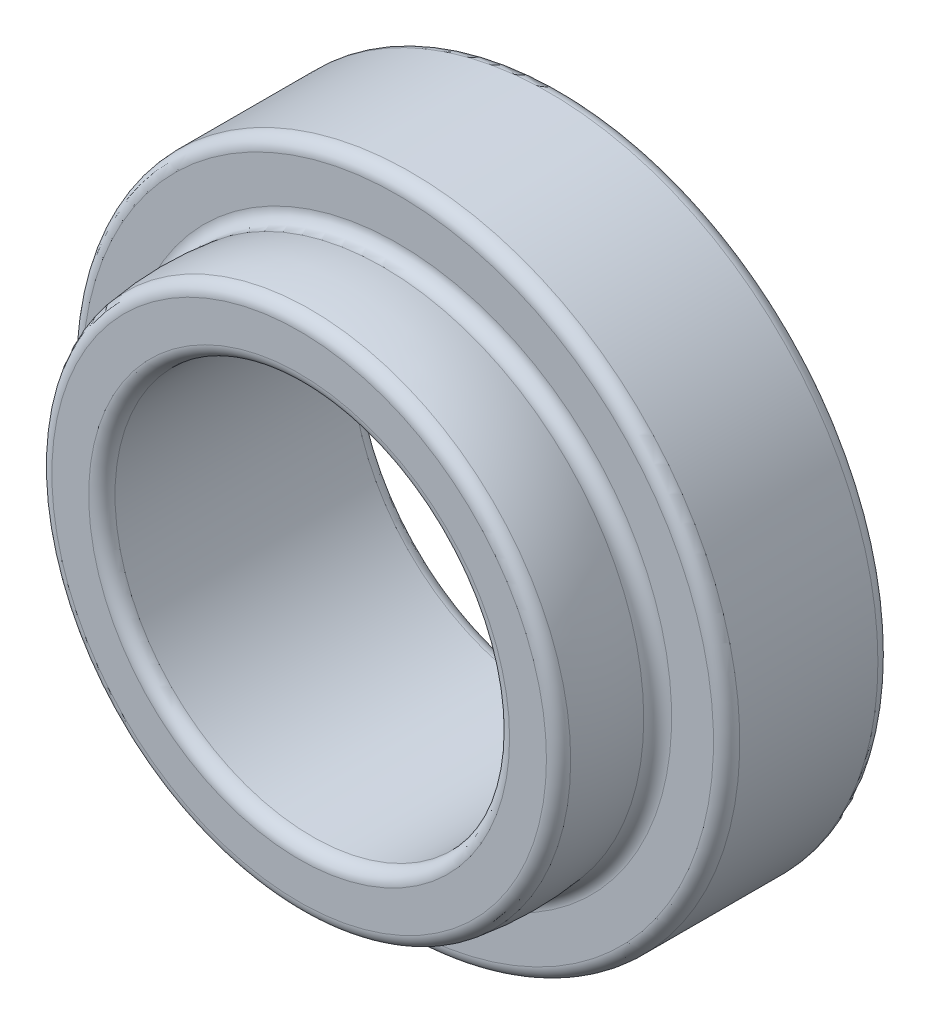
ISO-10303-21;
HEADER;
FILE_DESCRIPTION(('STEP AP214'),'2;1');
FILE_NAME('part.step','',(''),(''),'','','');
FILE_SCHEMA(('AUTOMOTIVE_DESIGN { 1 0 10303 214 1 1 1 1 }'));
ENDSEC;
DATA;
#1=APPLICATION_CONTEXT('core data for automotive mechanical design processes');
#2=APPLICATION_PROTOCOL_DEFINITION('international standard','automotive_design',2000,#1);
#3=PRODUCT_CONTEXT('',#1,'mechanical');
#4=PRODUCT('Part','Part','',(#3));
#5=PRODUCT_RELATED_PRODUCT_CATEGORY('part','',(#4));
#6=PRODUCT_DEFINITION_FORMATION('','',#4);
#7=PRODUCT_DEFINITION_CONTEXT('part definition',#1,'design');
#8=PRODUCT_DEFINITION('design','',#6,#7);
#9=PRODUCT_DEFINITION_SHAPE('','',#8);
#10=(LENGTH_UNIT() NAMED_UNIT(*) SI_UNIT(.MILLI.,.METRE.));
#11=(NAMED_UNIT(*) PLANE_ANGLE_UNIT() SI_UNIT($,.RADIAN.));
#12=(NAMED_UNIT(*) SI_UNIT($,.STERADIAN.) SOLID_ANGLE_UNIT());
#13=UNCERTAINTY_MEASURE_WITH_UNIT(LENGTH_MEASURE(1.E-05),#10,'distance_accuracy_value','');
#14=(GEOMETRIC_REPRESENTATION_CONTEXT(3) GLOBAL_UNCERTAINTY_ASSIGNED_CONTEXT((#13)) GLOBAL_UNIT_ASSIGNED_CONTEXT((#10,
#11,#12)) REPRESENTATION_CONTEXT('',''));
#15=CARTESIAN_POINT('',(0.,0.,0.));
#16=DIRECTION('',(0.,0.,1.));
#17=DIRECTION('',(1.,0.,0.));
#18=AXIS2_PLACEMENT_3D('',#15,#16,#17);
#19=CARTESIAN_POINT('',(0.,0.,2.5));
#20=DIRECTION('',(0.,0.,-1.));
#21=DIRECTION('',(-1.,0.,0.));
#22=AXIS2_PLACEMENT_3D('',#19,#20,#21);
#23=PLANE('',#22);
#24=CARTESIAN_POINT('',(0.,0.,2.5));
#25=DIRECTION('',(0.,0.,-1.));
#26=DIRECTION('',(-1.,0.,0.));
#27=AXIS2_PLACEMENT_3D('',#24,#25,#26);
#28=CIRCLE('',#27,4.16383236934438);
#29=CARTESIAN_POINT('',(-4.16383236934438,0.,2.5));
#30=VERTEX_POINT('',#29);
#31=EDGE_CURVE('E49',#30,#30,#28,.T.);
#32=ORIENTED_EDGE('',*,*,#31,.T.);
#33=EDGE_LOOP('',(#32));
#34=FACE_BOUND('',#33,.T.);
#35=CARTESIAN_POINT('',(0.,0.,2.5));
#36=DIRECTION('',(0.,0.,-1.));
#37=DIRECTION('',(-1.,0.,0.));
#38=AXIS2_PLACEMENT_3D('',#35,#36,#37);
#39=CIRCLE('',#38,4.8);
#40=CARTESIAN_POINT('',(-4.8,0.,2.5));
#41=VERTEX_POINT('',#40);
#42=EDGE_CURVE('E52',#41,#41,#39,.F.);
#43=ORIENTED_EDGE('',*,*,#42,.T.);
#44=EDGE_LOOP('',(#43));
#45=FACE_BOUND('',#44,.T.);
#46=ADVANCED_FACE('F29',(#34,#45),#23,.F.);
#47=CARTESIAN_POINT('',(0.,0.,4.));
#48=DIRECTION('',(0.,0.,1.));
#49=DIRECTION('',(1.,0.,0.));
#50=AXIS2_PLACEMENT_3D('',#47,#48,#49);
#51=PLANE('',#50);
#52=CARTESIAN_POINT('',(0.,0.,4.));
#53=DIRECTION('',(0.,0.,1.));
#54=DIRECTION('',(1.,0.,0.));
#55=AXIS2_PLACEMENT_3D('',#52,#53,#54);
#56=CIRCLE('',#55,3.2);
#57=CARTESIAN_POINT('',(3.2,0.,4.));
#58=VERTEX_POINT('',#57);
#59=EDGE_CURVE('E10',#58,#58,#56,.F.);
#60=ORIENTED_EDGE('',*,*,#59,.T.);
#61=EDGE_LOOP('',(#60));
#62=FACE_BOUND('',#61,.T.);
#63=CARTESIAN_POINT('',(0.,0.,4.));
#64=DIRECTION('',(0.,0.,1.));
#65=DIRECTION('',(1.,0.,0.));
#66=AXIS2_PLACEMENT_3D('',#63,#64,#65);
#67=CIRCLE('',#66,3.75998670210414);
#68=CARTESIAN_POINT('',(3.75998670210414,0.,4.));
#69=VERTEX_POINT('',#68);
#70=EDGE_CURVE('E36',#69,#69,#67,.T.);
#71=ORIENTED_EDGE('',*,*,#70,.T.);
#72=EDGE_LOOP('',(#71));
#73=FACE_BOUND('',#72,.T.);
#74=ADVANCED_FACE('F31',(#62,#73),#51,.T.);
#75=CARTESIAN_POINT('',(0.,0.,0.));
#76=DIRECTION('',(0.,0.,1.));
#77=DIRECTION('',(1.,0.,0.));
#78=AXIS2_PLACEMENT_3D('',#75,#76,#77);
#79=PLANE('',#78);
#80=CARTESIAN_POINT('',(0.,0.,0.));
#81=DIRECTION('',(0.,0.,1.));
#82=DIRECTION('',(1.,0.,0.));
#83=AXIS2_PLACEMENT_3D('',#80,#81,#82);
#84=CIRCLE('',#83,4.8);
#85=CARTESIAN_POINT('',(4.8,0.,0.));
#86=VERTEX_POINT('',#85);
#87=EDGE_CURVE('E67',#86,#86,#84,.F.);
#88=ORIENTED_EDGE('',*,*,#87,.T.);
#89=EDGE_LOOP('',(#88));
#90=FACE_BOUND('',#89,.T.);
#91=CARTESIAN_POINT('',(0.,0.,0.));
#92=DIRECTION('',(0.,0.,1.));
#93=DIRECTION('',(1.,0.,0.));
#94=AXIS2_PLACEMENT_3D('',#91,#92,#93);
#95=CIRCLE('',#94,3.2);
#96=CARTESIAN_POINT('',(3.2,0.,0.));
#97=VERTEX_POINT('',#96);
#98=EDGE_CURVE('E70',#97,#97,#95,.T.);
#99=ORIENTED_EDGE('',*,*,#98,.T.);
#100=EDGE_LOOP('',(#99));
#101=FACE_BOUND('',#100,.T.);
#102=ADVANCED_FACE('F74',(#90,#101),#79,.F.);
#103=CARTESIAN_POINT('',(0.,0.,4.));
#104=DIRECTION('',(0.,0.,-1.));
#105=DIRECTION('',(-1.,0.,0.));
#106=AXIS2_PLACEMENT_3D('',#103,#104,#105);
#107=CYLINDRICAL_SURFACE('',#106,3.);
#108=CARTESIAN_POINT('',(0.,0.,0.2));
#109=DIRECTION('',(0.,0.,1.));
#110=DIRECTION('',(1.,0.,0.));
#111=AXIS2_PLACEMENT_3D('',#108,#109,#110);
#112=CIRCLE('',#111,3.);
#113=CARTESIAN_POINT('',(3.,0.,0.2));
#114=VERTEX_POINT('',#113);
#115=EDGE_CURVE('E40',#114,#114,#112,.F.);
#116=ORIENTED_EDGE('',*,*,#115,.T.);
#117=EDGE_LOOP('',(#116));
#118=FACE_BOUND('',#117,.T.);
#119=CARTESIAN_POINT('',(0.,0.,3.8));
#120=DIRECTION('',(0.,0.,1.));
#121=DIRECTION('',(1.,0.,0.));
#122=AXIS2_PLACEMENT_3D('',#119,#120,#121);
#123=CIRCLE('',#122,3.);
#124=CARTESIAN_POINT('',(3.,0.,3.8));
#125=VERTEX_POINT('',#124);
#126=EDGE_CURVE('E44',#125,#125,#123,.T.);
#127=ORIENTED_EDGE('',*,*,#126,.T.);
#128=EDGE_LOOP('',(#127));
#129=FACE_BOUND('',#128,.T.);
#130=ADVANCED_FACE('F107',(#118,#129),#107,.F.);
#131=CARTESIAN_POINT('',(0.,0.,2.5));
#132=DIRECTION('',(0.,0.,-1.));
#133=DIRECTION('',(-1.,0.,0.));
#134=AXIS2_PLACEMENT_3D('',#131,#132,#133);
#135=CYLINDRICAL_SURFACE('',#134,5.);
#136=CARTESIAN_POINT('',(0.,0.,0.2));
#137=DIRECTION('',(0.,0.,1.));
#138=DIRECTION('',(1.,0.,0.));
#139=AXIS2_PLACEMENT_3D('',#136,#137,#138);
#140=CIRCLE('',#139,5.);
#141=CARTESIAN_POINT('',(5.,0.,0.2));
#142=VERTEX_POINT('',#141);
#143=EDGE_CURVE('E61',#142,#142,#140,.T.);
#144=ORIENTED_EDGE('',*,*,#143,.T.);
#145=EDGE_LOOP('',(#144));
#146=FACE_BOUND('',#145,.T.);
#147=CARTESIAN_POINT('',(0.,0.,2.3));
#148=DIRECTION('',(0.,0.,-1.));
#149=DIRECTION('',(-1.,0.,0.));
#150=AXIS2_PLACEMENT_3D('',#147,#148,#149);
#151=CIRCLE('',#150,5.);
#152=CARTESIAN_POINT('',(-5.,0.,2.3));
#153=VERTEX_POINT('',#152);
#154=EDGE_CURVE('E64',#153,#153,#151,.T.);
#155=ORIENTED_EDGE('',*,*,#154,.T.);
#156=EDGE_LOOP('',(#155));
#157=FACE_BOUND('',#156,.T.);
#158=ADVANCED_FACE('F104',(#146,#157),#135,.T.);
#159=CARTESIAN_POINT('',(0.,0.,3.25));
#160=DIRECTION('',(0.,0.,-1.));
#161=DIRECTION('',(1.,0.,0.));
#162=AXIS2_PLACEMENT_3D('',#159,#160,#161);
#163=SPHERICAL_SURFACE('',#162,4.);
#164=CARTESIAN_POINT('',(0.,0.,2.72619047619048));
#165=DIRECTION('',(0.,0.,1.));
#166=DIRECTION('',(1.,0.,0.));
#167=AXIS2_PLACEMENT_3D('',#164,#165,#166);
#168=CIRCLE('',#167,3.96555463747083);
#169=CARTESIAN_POINT('',(3.96555463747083,0.,2.72619047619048));
#170=VERTEX_POINT('',#169);
#171=EDGE_CURVE('E55',#170,#170,#168,.T.);
#172=CARTESIAN_POINT('',(0.,0.,3.82894736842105));
#173=DIRECTION('',(0.,0.,-1.));
#174=DIRECTION('',(-1.,0.,0.));
#175=AXIS2_PLACEMENT_3D('',#172,#173,#174);
#176=CIRCLE('',#175,3.95788073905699);
#177=CARTESIAN_POINT('',(3.95788073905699,0.,3.82894736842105));
#178=VERTEX_POINT('',#177);
#179=EDGE_CURVE('E58',#178,#178,#176,.T.);
#180=CARTESIAN_POINT('',(3.96555463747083,0.,2.72619047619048));
#181=CARTESIAN_POINT('',(3.9670637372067,0.,2.73761526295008));
#182=CARTESIAN_POINT('',(3.96852346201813,0.,2.74904657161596));
#183=CARTESIAN_POINT('',(3.97134405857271,0.,2.77192137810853));
#184=CARTESIAN_POINT('',(3.97270493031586,0.,2.78336487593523));
#185=CARTESIAN_POINT('',(3.97532771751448,0.,2.80626320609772));
#186=CARTESIAN_POINT('',(3.97658963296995,0.,2.81771803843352));
#187=CARTESIAN_POINT('',(3.97901441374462,0.,2.84063818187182));
#188=CARTESIAN_POINT('',(3.98017727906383,0.,2.85210349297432));
#189=CARTESIAN_POINT('',(3.98240387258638,0.,2.8750437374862));
#190=CARTESIAN_POINT('',(3.98346760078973,0.,2.88651867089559));
#191=CARTESIAN_POINT('',(3.98549584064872,0.,2.90947730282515));
#192=CARTESIAN_POINT('',(3.98646035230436,0.,2.92096100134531));
#193=CARTESIAN_POINT('',(3.98829008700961,0.,2.94393630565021));
#194=CARTESIAN_POINT('',(3.98915531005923,0.,2.95542791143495));
#195=CARTESIAN_POINT('',(3.9907864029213,0.,2.97841817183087));
#196=CARTESIAN_POINT('',(3.99155227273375,0.,2.98991682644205));
#197=CARTESIAN_POINT('',(3.99298460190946,0.,3.01292032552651));
#198=CARTESIAN_POINT('',(3.99365106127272,0.,3.02442516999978));
#199=CARTESIAN_POINT('',(3.9948845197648,0.,3.04744018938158));
#200=CARTESIAN_POINT('',(3.99545151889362,0.,3.05895036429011));
#201=CARTESIAN_POINT('',(3.99648601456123,0.,3.08197518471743));
#202=CARTESIAN_POINT('',(3.99695351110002,0.,3.09348983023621));
#203=CARTESIAN_POINT('',(3.99778896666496,0.,3.11652273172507));
#204=CARTESIAN_POINT('',(3.99815692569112,0.,3.12804098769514));
#205=CARTESIAN_POINT('',(3.99879327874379,0.,3.1510802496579));
#206=CARTESIAN_POINT('',(3.9990616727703,0.,3.16260125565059));
#207=CARTESIAN_POINT('',(3.99949887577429,0.,3.18564515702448));
#208=CARTESIAN_POINT('',(3.99966768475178,0.,3.19716805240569));
#209=CARTESIAN_POINT('',(3.99990570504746,0.,3.22021487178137));
#210=CARTESIAN_POINT('',(3.99997491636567,0.,3.23173879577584));
#211=CARTESIAN_POINT('',(4.00001373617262,0.,3.25478681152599));
#212=CARTESIAN_POINT('',(3.99998334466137,0.,3.26631090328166));
#213=CARTESIAN_POINT('',(3.99982296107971,0.,3.28935839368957));
#214=CARTESIAN_POINT('',(3.99969296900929,0.,3.30088179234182));
#215=CARTESIAN_POINT('',(3.99933339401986,0.,3.32392703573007));
#216=CARTESIAN_POINT('',(3.99910381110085,0.,3.33544888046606));
#217=CARTESIAN_POINT('',(3.99854507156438,0.,3.35849015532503));
#218=CARTESIAN_POINT('',(3.99821591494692,0.,3.37000958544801));
#219=CARTESIAN_POINT('',(3.99745805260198,0.,3.39304517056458));
#220=CARTESIAN_POINT('',(3.9970293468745,0.,3.40456132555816));
#221=CARTESIAN_POINT('',(3.99607241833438,0.,3.42758950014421));
#222=CARTESIAN_POINT('',(3.99554419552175,0.,3.43910151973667));
#223=CARTESIAN_POINT('',(3.99438827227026,0.,3.46212056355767));
#224=CARTESIAN_POINT('',(3.99376057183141,0.,3.47362758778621));
#225=CARTESIAN_POINT('',(3.99240574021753,0.,3.4966357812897));
#226=CARTESIAN_POINT('',(3.99167860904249,0.,3.50813695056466));
#227=CARTESIAN_POINT('',(3.9901249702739,0.,3.53113257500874));
#228=CARTESIAN_POINT('',(3.98929846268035,0.,3.54262703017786));
#229=CARTESIAN_POINT('',(3.98754613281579,0.,3.56560836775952));
#230=CARTESIAN_POINT('',(3.98662031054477,0.,3.57709525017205));
#231=CARTESIAN_POINT('',(3.98466942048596,0.,3.60006058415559));
#232=CARTESIAN_POINT('',(3.98364435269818,0.,3.61153903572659));
#233=CARTESIAN_POINT('',(3.98149504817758,0.,3.63448665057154));
#234=CARTESIAN_POINT('',(3.98037081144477,0.,3.64595581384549));
#235=CARTESIAN_POINT('',(3.97802325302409,0.,3.66888399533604));
#236=CARTESIAN_POINT('',(3.97679993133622,0.,3.68034301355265));
#237=CARTESIAN_POINT('',(3.97425429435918,0.,3.70325004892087));
#238=CARTESIAN_POINT('',(3.97293197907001,0.,3.71469806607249));
#239=CARTESIAN_POINT('',(3.97018845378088,0.,3.73758224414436));
#240=CARTESIAN_POINT('',(3.96876724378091,0.,3.74901840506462));
#241=CARTESIAN_POINT('',(3.96582603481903,0.,3.77187801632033));
#242=CARTESIAN_POINT('',(3.96430603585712,0.,3.78330146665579));
#243=CARTESIAN_POINT('',(3.96116736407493,0.,3.80613480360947));
#244=CARTESIAN_POINT('',(3.95954869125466,0.,3.81754469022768));
#245=CARTESIAN_POINT('',(3.95788073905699,0.,3.82894736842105));
#246=B_SPLINE_CURVE_WITH_KNOTS('',3,(#180,#181,#182,#183,#184,#185,#186,#187,#188,#189,#190,
#191,#192,#193,#194,#195,#196,#197,#198,#199,#200,#201,#202,#203,#204,#205,#206,#207,#208,#209,
#210,#211,#212,#213,#214,#215,#216,#217,#218,#219,#220,#221,#222,#223,#224,#225,#226,#227,#228,
#229,#230,#231,#232,#233,#234,#235,#236,#237,#238,#239,#240,#241,#242,#243,#244,#245),
.UNSPECIFIED.,.F.,.F.,(4,2,2,2,2,2,2,2,2,2,2,2,2,2,2,2,2,2,2,2,2,2,2,2,2,2,2,2,2,2,2,2,4),(0.,
0.0345719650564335,0.0691439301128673,0.103715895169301,0.138287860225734,0.172859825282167,
0.2074317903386,0.242003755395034,0.276575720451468,0.311147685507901,0.345719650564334,
0.380291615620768,0.414863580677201,0.449435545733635,0.484007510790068,0.518579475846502,
0.553151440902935,0.587723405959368,0.622295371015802,0.656867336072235,0.691439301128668,
0.726011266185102,0.760583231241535,0.795155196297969,0.829727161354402,0.864299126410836,
0.898871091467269,0.933443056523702,0.968015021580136,1.00258698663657,1.037158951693,
1.07173091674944,1.10630288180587),.UNSPECIFIED.);
#247=EDGE_CURVE('BSEAM102',#170,#178,#246,.T.);
#248=ORIENTED_EDGE('',*,*,#171,.T.);
#249=ORIENTED_EDGE('',*,*,#179,.T.);
#250=ORIENTED_EDGE('',*,*,#247,.T.);
#251=ORIENTED_EDGE('',*,*,#247,.F.);
#252=EDGE_LOOP('',(#248,#250,#249,#251));
#253=FACE_BOUND('',#252,.T.);
#254=ADVANCED_FACE('F102',(#253),#163,.T.);
#255=CARTESIAN_POINT('',(0.,0.,0.2));
#256=DIRECTION('',(0.,0.,1.));
#257=DIRECTION('',(1.,0.,0.));
#258=AXIS2_PLACEMENT_3D('',#255,#256,#257);
#259=TOROIDAL_SURFACE('',#258,4.8,0.2);
#260=ORIENTED_EDGE('',*,*,#143,.F.);
#261=EDGE_LOOP('',(#260));
#262=FACE_BOUND('',#261,.T.);
#263=ORIENTED_EDGE('',*,*,#87,.F.);
#264=EDGE_LOOP('',(#263));
#265=FACE_BOUND('',#264,.T.);
#266=ADVANCED_FACE('F117',(#262,#265),#259,.T.);
#267=CARTESIAN_POINT('',(0.,0.,2.7));
#268=DIRECTION('',(0.,0.,-1.));
#269=DIRECTION('',(-1.,0.,0.));
#270=AXIS2_PLACEMENT_3D('',#267,#268,#269);
#271=TOROIDAL_SURFACE('',#270,4.16383236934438,0.2);
#272=ORIENTED_EDGE('',*,*,#31,.F.);
#273=EDGE_LOOP('',(#272));
#274=FACE_BOUND('',#273,.T.);
#275=ORIENTED_EDGE('',*,*,#171,.F.);
#276=EDGE_LOOP('',(#275));
#277=FACE_BOUND('',#276,.T.);
#278=ADVANCED_FACE('F89',(#274,#277),#271,.F.);
#279=CARTESIAN_POINT('',(0.,0.,2.3));
#280=DIRECTION('',(0.,0.,-1.));
#281=DIRECTION('',(-1.,0.,0.));
#282=AXIS2_PLACEMENT_3D('',#279,#280,#281);
#283=TOROIDAL_SURFACE('',#282,4.8,0.2);
#284=ORIENTED_EDGE('',*,*,#42,.F.);
#285=EDGE_LOOP('',(#284));
#286=FACE_BOUND('',#285,.T.);
#287=ORIENTED_EDGE('',*,*,#154,.F.);
#288=EDGE_LOOP('',(#287));
#289=FACE_BOUND('',#288,.T.);
#290=ADVANCED_FACE('F79',(#286,#289),#283,.T.);
#291=CARTESIAN_POINT('',(0.,0.,0.2));
#292=DIRECTION('',(0.,0.,1.));
#293=DIRECTION('',(1.,0.,0.));
#294=AXIS2_PLACEMENT_3D('',#291,#292,#293);
#295=TOROIDAL_SURFACE('',#294,3.2,0.2);
#296=ORIENTED_EDGE('',*,*,#115,.F.);
#297=EDGE_LOOP('',(#296));
#298=FACE_BOUND('',#297,.T.);
#299=ORIENTED_EDGE('',*,*,#98,.F.);
#300=EDGE_LOOP('',(#299));
#301=FACE_BOUND('',#300,.T.);
#302=ADVANCED_FACE('F76',(#298,#301),#295,.T.);
#303=CARTESIAN_POINT('',(0.,0.,3.8));
#304=DIRECTION('',(0.,0.,1.));
#305=DIRECTION('',(1.,0.,0.));
#306=AXIS2_PLACEMENT_3D('',#303,#304,#305);
#307=TOROIDAL_SURFACE('',#306,3.2,0.2);
#308=ORIENTED_EDGE('',*,*,#59,.F.);
#309=EDGE_LOOP('',(#308));
#310=FACE_BOUND('',#309,.T.);
#311=ORIENTED_EDGE('',*,*,#126,.F.);
#312=EDGE_LOOP('',(#311));
#313=FACE_BOUND('',#312,.T.);
#314=ADVANCED_FACE('F78',(#310,#313),#307,.T.);
#315=CARTESIAN_POINT('',(0.,0.,3.8));
#316=DIRECTION('',(0.,0.,1.));
#317=DIRECTION('',(1.,0.,0.));
#318=AXIS2_PLACEMENT_3D('',#315,#316,#317);
#319=TOROIDAL_SURFACE('',#318,3.75998670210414,0.2);
#320=ORIENTED_EDGE('',*,*,#70,.F.);
#321=EDGE_LOOP('',(#320));
#322=FACE_BOUND('',#321,.T.);
#323=ORIENTED_EDGE('',*,*,#179,.F.);
#324=EDGE_LOOP('',(#323));
#325=FACE_BOUND('',#324,.T.);
#326=ADVANCED_FACE('F86',(#322,#325),#319,.T.);
#327=CLOSED_SHELL('',(#46,#74,#102,#130,#158,#254,#266,#278,#290,#302,#314,#326));
#328=MANIFOLD_SOLID_BREP('B2',#327);
#329=ADVANCED_BREP_SHAPE_REPRESENTATION('',(#18,#328),#14);
#330=SHAPE_DEFINITION_REPRESENTATION(#9,#329);
ENDSEC;
END-ISO-10303-21;
